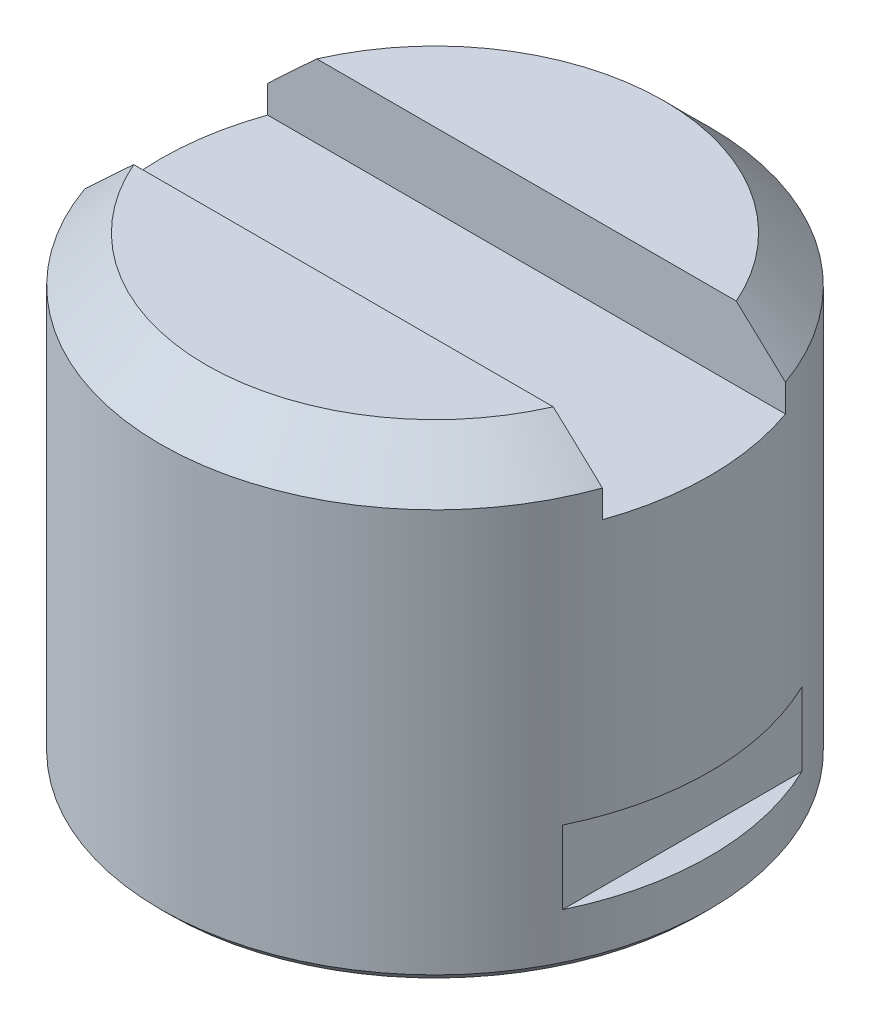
ISO-10303-21;
HEADER;
FILE_DESCRIPTION(('STEP AP214'),'2;1');
FILE_NAME('part.step','',(''),(''),'','','');
FILE_SCHEMA(('AUTOMOTIVE_DESIGN { 1 0 10303 214 1 1 1 1 }'));
ENDSEC;
DATA;
#1=APPLICATION_CONTEXT('core data for automotive mechanical design processes');
#2=APPLICATION_PROTOCOL_DEFINITION('international standard','automotive_design',2000,#1);
#3=PRODUCT_CONTEXT('',#1,'mechanical');
#4=PRODUCT('Part','Part','',(#3));
#5=PRODUCT_RELATED_PRODUCT_CATEGORY('part','',(#4));
#6=PRODUCT_DEFINITION_FORMATION('','',#4);
#7=PRODUCT_DEFINITION_CONTEXT('part definition',#1,'design');
#8=PRODUCT_DEFINITION('design','',#6,#7);
#9=PRODUCT_DEFINITION_SHAPE('','',#8);
#10=(LENGTH_UNIT() NAMED_UNIT(*) SI_UNIT(.MILLI.,.METRE.));
#11=(NAMED_UNIT(*) PLANE_ANGLE_UNIT() SI_UNIT($,.RADIAN.));
#12=(NAMED_UNIT(*) SI_UNIT($,.STERADIAN.) SOLID_ANGLE_UNIT());
#13=UNCERTAINTY_MEASURE_WITH_UNIT(LENGTH_MEASURE(1.E-05),#10,'distance_accuracy_value','');
#14=(GEOMETRIC_REPRESENTATION_CONTEXT(3) GLOBAL_UNCERTAINTY_ASSIGNED_CONTEXT((#13)) GLOBAL_UNIT_ASSIGNED_CONTEXT((#10,
#11,#12)) REPRESENTATION_CONTEXT('',''));
#15=CARTESIAN_POINT('',(0.,0.,0.));
#16=DIRECTION('',(0.,0.,1.));
#17=DIRECTION('',(1.,0.,0.));
#18=AXIS2_PLACEMENT_3D('',#15,#16,#17);
#19=CARTESIAN_POINT('',(0.,50.,0.));
#20=DIRECTION('',(0.,1.,0.));
#21=DIRECTION('',(0.,0.,1.));
#22=AXIS2_PLACEMENT_3D('',#19,#20,#21);
#23=PLANE('',#22);
#24=DIRECTION('',(1.,0.,0.));
#25=VECTOR('',#24,1.);
#26=CARTESIAN_POINT('',(-30.,50.,9.99999999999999));
#27=LINE('',#26,#25);
#28=CARTESIAN_POINT('',(-22.9128784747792,50.,9.99999999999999));
#29=VERTEX_POINT('',#28);
#30=CARTESIAN_POINT('',(22.9128784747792,50.,9.99999999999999));
#31=VERTEX_POINT('',#30);
#32=EDGE_CURVE('E138',#29,#31,#27,.T.);
#33=ORIENTED_EDGE('',*,*,#32,.F.);
#34=CARTESIAN_POINT('',(0.,50.,0.));
#35=DIRECTION('',(0.,1.,0.));
#36=DIRECTION('',(0.,0.,1.));
#37=AXIS2_PLACEMENT_3D('',#34,#35,#36);
#38=CIRCLE('',#37,25.);
#39=EDGE_CURVE('E143',#29,#31,#38,.T.);
#40=ORIENTED_EDGE('',*,*,#39,.T.);
#41=EDGE_LOOP('',(#33,#40));
#42=FACE_BOUND('',#41,.T.);
#43=ADVANCED_FACE('F46',(#42),#23,.T.);
#44=CARTESIAN_POINT('',(0.,50.,0.));
#45=DIRECTION('',(0.,-1.,0.));
#46=DIRECTION('',(0.,0.,-1.));
#47=AXIS2_PLACEMENT_3D('',#44,#45,#46);
#48=CONICAL_SURFACE('',#47,25.,0.785398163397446);
#49=CARTESIAN_POINT('',(-65.3644664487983,8.87501626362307,10.));
#50=CARTESIAN_POINT('',(-64.4084204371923,9.82006334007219,10.));
#51=CARTESIAN_POINT('',(-63.4521407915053,10.7648740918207,10.));
#52=CARTESIAN_POINT('',(-61.5390376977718,12.6539476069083,10.));
#53=CARTESIAN_POINT('',(-60.5822142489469,13.598210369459,10.));
#54=CARTESIAN_POINT('',(-57.7096946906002,16.431166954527,10.));
#55=CARTESIAN_POINT('',(-55.7930707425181,18.3189202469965,10.));
#56=CARTESIAN_POINT('',(-51.9354031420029,22.1118137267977,10.));
#57=CARTESIAN_POINT('',(-49.9943228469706,24.0169166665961,10.));
#58=CARTESIAN_POINT('',(-47.079701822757,26.8703883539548,10.));
#59=CARTESIAN_POINT('',(-46.1079415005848,27.8205755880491,10.));
#60=CARTESIAN_POINT('',(-44.1630017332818,29.7194698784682,10.));
#61=CARTESIAN_POINT('',(-43.1898223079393,30.6681769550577,10.));
#62=CARTESIAN_POINT('',(-40.8635143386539,32.9318481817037,10.));
#63=CARTESIAN_POINT('',(-39.5095833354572,34.2459880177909,10.));
#64=CARTESIAN_POINT('',(-36.7971986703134,36.8697614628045,10.));
#65=CARTESIAN_POINT('',(-35.4387447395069,38.1793947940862,10.));
#66=CARTESIAN_POINT('',(-33.395067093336,40.1403680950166,10.));
#67=CARTESIAN_POINT('',(-32.7121460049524,40.7941077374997,10.));
#68=CARTESIAN_POINT('',(-31.3444537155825,42.0996483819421,10.));
#69=CARTESIAN_POINT('',(-30.6596825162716,42.7514493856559,10.));
#70=CARTESIAN_POINT('',(-29.2880684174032,44.0525630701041,10.));
#71=CARTESIAN_POINT('',(-28.6012260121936,44.701876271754,10.));
#72=CARTESIAN_POINT('',(-27.2248356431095,45.9976249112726,10.));
#73=CARTESIAN_POINT('',(-26.5352876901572,46.6440603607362,10.));
#74=CARTESIAN_POINT('',(-25.1588162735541,47.9277845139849,10.));
#75=CARTESIAN_POINT('',(-24.4719215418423,48.5651040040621,10.));
#76=CARTESIAN_POINT('',(-23.0940123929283,49.8353022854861,9.99999999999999));
#77=CARTESIAN_POINT('',(-22.4029979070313,50.4681810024,9.99999999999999));
#78=CARTESIAN_POINT('',(-21.0151253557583,51.728749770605,9.99999999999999));
#79=CARTESIAN_POINT('',(-20.3182626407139,52.356434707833,9.99999999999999));
#80=CARTESIAN_POINT('',(-18.9177877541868,53.6041778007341,9.99999999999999));
#81=CARTESIAN_POINT('',(-18.214175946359,54.2242363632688,9.99999999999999));
#82=CARTESIAN_POINT('',(-17.1533626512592,55.1453411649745,9.99999999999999));
#83=CARTESIAN_POINT('',(-16.7995528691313,55.4502939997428,9.99999999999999));
#84=CARTESIAN_POINT('',(-16.0893184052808,56.0571371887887,9.99999999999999));
#85=CARTESIAN_POINT('',(-15.7328937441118,56.3590275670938,9.99999999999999));
#86=CARTESIAN_POINT('',(-15.0168956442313,56.9592392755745,9.99999999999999));
#87=CARTESIAN_POINT('',(-14.6573214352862,57.2575596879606,9.99999999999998));
#88=CARTESIAN_POINT('',(-13.9345690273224,57.8498021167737,9.99999999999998));
#89=CARTESIAN_POINT('',(-13.5713908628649,58.143724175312,9.99999999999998));
#90=CARTESIAN_POINT('',(-12.8413159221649,58.7257599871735,9.99999999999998));
#91=CARTESIAN_POINT('',(-12.4744257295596,59.0138819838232,9.99999999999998));
#92=CARTESIAN_POINT('',(-11.7355271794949,59.5835413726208,9.99999999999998));
#93=CARTESIAN_POINT('',(-11.3635185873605,59.8650784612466,9.99999999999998));
#94=CARTESIAN_POINT('',(-10.6135438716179,60.4197524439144,9.99999999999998));
#95=CARTESIAN_POINT('',(-10.2355805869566,60.6928931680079,9.99999999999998));
#96=CARTESIAN_POINT('',(-9.47228445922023,61.2286463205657,9.99999999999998));
#97=CARTESIAN_POINT('',(-9.08695262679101,61.4912601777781,9.99999999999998));
#98=CARTESIAN_POINT('',(-8.59967155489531,61.8110282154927,9.99999999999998));
#99=CARTESIAN_POINT('',(-8.50190286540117,61.8745771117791,9.99999999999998));
#100=CARTESIAN_POINT('',(-8.30577059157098,62.000762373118,9.99999999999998));
#101=CARTESIAN_POINT('',(-8.20740697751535,62.0633986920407,9.99999999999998));
#102=CARTESIAN_POINT('',(-8.01005188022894,62.1876989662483,9.99999999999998));
#103=CARTESIAN_POINT('',(-7.91106032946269,62.2493628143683,9.99999999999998));
#104=CARTESIAN_POINT('',(-7.71243223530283,62.3716395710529,9.99999999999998));
#105=CARTESIAN_POINT('',(-7.61279569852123,62.4322524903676,9.99999999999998));
#106=CARTESIAN_POINT('',(-7.31283812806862,62.6124247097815,9.99999999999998));
#107=CARTESIAN_POINT('',(-7.11149900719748,62.7302986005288,9.99999999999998));
#108=CARTESIAN_POINT('',(-6.70587341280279,62.9608597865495,9.99999999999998));
#109=CARTESIAN_POINT('',(-6.50158698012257,63.0735471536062,9.99999999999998));
#110=CARTESIAN_POINT('',(-6.09140900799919,63.2920807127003,9.99999999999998));
#111=CARTESIAN_POINT('',(-5.88554235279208,63.3979733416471,9.99999999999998));
#112=CARTESIAN_POINT('',(-5.47044909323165,63.602927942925,9.99999999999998));
#113=CARTESIAN_POINT('',(-5.26122240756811,63.7019897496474,9.99999999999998));
#114=CARTESIAN_POINT('',(-4.62826346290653,63.9873317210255,9.99999999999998));
#115=CARTESIAN_POINT('',(-4.19904989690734,64.1618785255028,9.99999999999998));
#116=CARTESIAN_POINT('',(-3.47039222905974,64.4184591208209,9.99999999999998));
#117=CARTESIAN_POINT('',(-3.17499506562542,64.5119948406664,9.99999999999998));
#118=CARTESIAN_POINT('',(-2.57807430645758,64.6770030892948,9.99999999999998));
#119=CARTESIAN_POINT('',(-2.27655208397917,64.7484805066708,9.99999999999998));
#120=CARTESIAN_POINT('',(-1.6695806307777,64.8659372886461,9.99999999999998));
#121=CARTESIAN_POINT('',(-1.36414828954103,64.9120027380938,9.99999999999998));
#122=CARTESIAN_POINT('',(-0.750339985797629,64.9765313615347,9.99999999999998));
#123=CARTESIAN_POINT('',(-0.441964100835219,64.9949952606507,9.99999999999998));
#124=CARTESIAN_POINT('',(0.176559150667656,65.0032438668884,9.99999999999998));
#125=CARTESIAN_POINT('',(0.486708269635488,64.992899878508,9.99999999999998));
#126=CARTESIAN_POINT('',(1.10473358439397,64.9438828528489,9.99999999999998));
#127=CARTESIAN_POINT('',(1.41260968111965,64.9052085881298,9.99999999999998));
#128=CARTESIAN_POINT('',(2.02478370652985,64.8015493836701,9.99999999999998));
#129=CARTESIAN_POINT('',(2.32906808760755,64.7364856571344,9.99999999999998));
#130=CARTESIAN_POINT('',(2.93169426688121,64.5831947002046,9.99999999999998));
#131=CARTESIAN_POINT('',(3.23003546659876,64.494965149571,9.99999999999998));
#132=CARTESIAN_POINT('',(3.83484796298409,64.2938967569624,9.99999999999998));
#133=CARTESIAN_POINT('',(4.14098015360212,64.1800482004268,9.99999999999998));
#134=CARTESIAN_POINT('',(4.74600489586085,63.9343742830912,9.99999999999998));
#135=CARTESIAN_POINT('',(5.04489459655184,63.8025419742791,9.99999999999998));
#136=CARTESIAN_POINT('',(5.63616156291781,63.5240162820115,9.99999999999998));
#137=CARTESIAN_POINT('',(5.92852840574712,63.377300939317,9.99999999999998));
#138=CARTESIAN_POINT('',(6.50687191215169,63.071920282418,9.99999999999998));
#139=CARTESIAN_POINT('',(6.79284928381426,62.9132563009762,9.99999999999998));
#140=CARTESIAN_POINT('',(7.36135649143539,62.5848756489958,9.99999999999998));
#141=CARTESIAN_POINT('',(7.64384166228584,62.4150820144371,9.99999999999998));
#142=CARTESIAN_POINT('',(8.20374548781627,62.0673550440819,9.99999999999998));
#143=CARTESIAN_POINT('',(8.48116403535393,61.8894215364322,9.99999999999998));
#144=CARTESIAN_POINT('',(9.03130723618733,61.5269998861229,9.99999999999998));
#145=CARTESIAN_POINT('',(9.30403596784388,61.3425179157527,9.99999999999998));
#146=CARTESIAN_POINT('',(9.84560947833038,60.9679728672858,9.99999999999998));
#147=CARTESIAN_POINT('',(10.1144543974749,60.7779099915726,9.99999999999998));
#148=CARTESIAN_POINT('',(10.6723910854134,60.3760733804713,9.99999999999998));
#149=CARTESIAN_POINT('',(10.961170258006,60.1638663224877,9.99999999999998));
#150=CARTESIAN_POINT('',(11.5352657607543,59.734810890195,9.99999999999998));
#151=CARTESIAN_POINT('',(11.8205819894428,59.5179623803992,9.99999999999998));
#152=CARTESIAN_POINT('',(12.3882373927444,59.0803348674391,9.99999999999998));
#153=CARTESIAN_POINT('',(12.6705761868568,58.8595553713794,9.99999999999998));
#154=CARTESIAN_POINT('',(13.2326275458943,58.4146755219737,9.99999999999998));
#155=CARTESIAN_POINT('',(13.5123400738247,58.1905751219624,9.99999999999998));
#156=CARTESIAN_POINT('',(14.3483275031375,57.5138034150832,9.99999999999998));
#157=CARTESIAN_POINT('',(14.9011650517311,57.0568846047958,9.99999999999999));
#158=CARTESIAN_POINT('',(15.9996989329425,56.1346463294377,9.99999999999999));
#159=CARTESIAN_POINT('',(16.5453957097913,55.6693273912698,9.99999999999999));
#160=CARTESIAN_POINT('',(17.6321617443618,54.7313615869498,9.99999999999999));
#161=CARTESIAN_POINT('',(18.1732209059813,54.2587030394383,9.99999999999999));
#162=CARTESIAN_POINT('',(19.2508443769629,53.3082831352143,9.99999999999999));
#163=CARTESIAN_POINT('',(19.7874086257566,52.8305217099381,9.99999999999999));
#164=CARTESIAN_POINT('',(20.8567225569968,51.8710743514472,9.99999999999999));
#165=CARTESIAN_POINT('',(21.3894733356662,51.3893896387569,9.99999999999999));
#166=CARTESIAN_POINT('',(22.4519706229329,50.4227259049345,9.99999999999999));
#167=CARTESIAN_POINT('',(22.9817171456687,49.9377468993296,9.99999999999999));
#168=CARTESIAN_POINT('',(24.0370887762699,48.9665770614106,10.));
#169=CARTESIAN_POINT('',(24.5627215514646,48.4803945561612,10.));
#170=CARTESIAN_POINT('',(25.6119022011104,47.5057843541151,10.));
#171=CARTESIAN_POINT('',(26.1354500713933,47.0173566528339,10.));
#172=CARTESIAN_POINT('',(27.7035297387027,45.5491908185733,10.));
#173=CARTESIAN_POINT('',(28.7454251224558,44.5666368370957,10.));
#174=CARTESIAN_POINT('',(30.8230293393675,42.5970618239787,10.));
#175=CARTESIAN_POINT('',(31.8587432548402,41.6100461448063,10.));
#176=CARTESIAN_POINT('',(33.9262354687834,39.6319475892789,10.));
#177=CARTESIAN_POINT('',(34.9580138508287,38.6408648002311,10.));
#178=CARTESIAN_POINT('',(37.2221843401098,36.4593487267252,10.));
#179=CARTESIAN_POINT('',(38.453918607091,35.2682330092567,10.));
#180=CARTESIAN_POINT('',(40.9141124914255,32.8826108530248,10.));
#181=CARTESIAN_POINT('',(42.1425720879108,31.6881043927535,10.));
#182=CARTESIAN_POINT('',(44.5973677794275,29.2960702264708,10.));
#183=CARTESIAN_POINT('',(45.8237030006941,28.0985416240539,10.));
#184=CARTESIAN_POINT('',(48.2743620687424,25.7014279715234,10.));
#185=CARTESIAN_POINT('',(49.49868591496,24.5018429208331,10.));
#186=CARTESIAN_POINT('',(51.9451430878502,22.1015882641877,10.));
#187=CARTESIAN_POINT('',(53.1672771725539,20.9009194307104,10.));
#188=CARTESIAN_POINT('',(55.6102282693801,18.4982411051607,10.));
#189=CARTESIAN_POINT('',(56.8310452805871,17.2962316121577,10.));
#190=CARTESIAN_POINT('',(59.2711495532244,14.891546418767,10.));
#191=CARTESIAN_POINT('',(60.4904372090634,13.6888711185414,10.));
#192=CARTESIAN_POINT('',(62.9280960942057,11.2825946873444,10.));
#193=CARTESIAN_POINT('',(64.146467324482,10.0789935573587,10.));
#194=CARTESIAN_POINT('',(65.3644664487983,8.87501626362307,10.));
#195=B_SPLINE_CURVE_WITH_KNOTS('',3,(#49,#50,#51,#52,#53,#54,#55,#56,#57,#58,#59,#60,#61,#62,
#63,#64,#65,#66,#67,#68,#69,#70,#71,#72,#73,#74,#75,#76,#77,#78,#79,#80,#81,#82,#83,#84,#85,#86,
#87,#88,#89,#90,#91,#92,#93,#94,#95,#96,#97,#98,#99,#100,#101,#102,#103,#104,#105,#106,#107,
#108,#109,#110,#111,#112,#113,#114,#115,#116,#117,#118,#119,#120,#121,#122,#123,#124,#125,#126,
#127,#128,#129,#130,#131,#132,#133,#134,#135,#136,#137,#138,#139,#140,#141,#142,#143,#144,#145,
#146,#147,#148,#149,#150,#151,#152,#153,#154,#155,#156,#157,#158,#159,#160,#161,#162,#163,#164,
#165,#166,#167,#168,#169,#170,#171,#172,#173,#174,#175,#176,#177,#178,#179,#180,#181,#182,#183,
#184,#185,#186,#187,#188,#189,#190,#191,#192,#193,#194),.UNSPECIFIED.,.F.,.F.,(4,2,2,2,2,2,2,2,
2,2,2,2,2,2,2,2,2,2,2,2,2,2,2,2,2,2,2,2,2,2,2,2,2,2,2,2,2,2,2,2,2,2,2,2,2,2,2,2,2,2,2,2,2,2,2,2,
2,2,2,2,2,2,2,2,2,2,2,2,2,2,2,2,4),(0.,4.0328949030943,8.06579559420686,16.1363280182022,
24.295664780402,28.3729868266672,32.4502525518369,38.1107077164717,43.7715055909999,
46.6076638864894,49.4438196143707,52.2793449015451,55.1148587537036,57.9258942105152,
60.7369766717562,63.5505587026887,66.3639899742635,67.7652608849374,69.1665207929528,
70.5681335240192,71.9697328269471,73.3691749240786,74.7686813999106,76.1675397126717,
77.5662075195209,77.9160248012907,78.2658597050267,78.6157328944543,78.9656025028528,
79.6654476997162,80.3652832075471,81.0596694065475,81.7540724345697,83.1421885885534,
84.0710581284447,84.9997216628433,85.9252196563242,86.8506933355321,87.7803080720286,
88.7099630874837,89.6424142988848,90.5749589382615,91.5541204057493,92.5336612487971,
93.5146689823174,94.495567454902,95.4841634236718,96.472780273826,97.4604888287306,
98.4481616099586,99.5231994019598,100.598268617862,101.67347359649,102.748693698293,
104.900224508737,107.051620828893,109.206889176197,111.36218651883,113.516837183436,
115.671477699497,117.81948503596,119.967496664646,124.263815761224,128.555903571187,
132.847899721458,137.988254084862,143.128641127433,148.270792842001,153.41294599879,
158.552687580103,163.69243273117,168.830312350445,173.968186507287),.UNSPECIFIED.);
#196=CARTESIAN_POINT('',(-28.2842712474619,45.,10.));
#197=VERTEX_POINT('',#196);
#198=EDGE_CURVE('E227',#197,#29,#195,.T.);
#199=ORIENTED_EDGE('',*,*,#198,.F.);
#200=CARTESIAN_POINT('',(0.,45.,0.));
#201=DIRECTION('',(0.,1.,0.));
#202=DIRECTION('',(0.,0.,1.));
#203=AXIS2_PLACEMENT_3D('',#200,#201,#202);
#204=CIRCLE('',#203,30.);
#205=CARTESIAN_POINT('',(28.2842712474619,45.,10.));
#206=VERTEX_POINT('',#205);
#207=EDGE_CURVE('E142',#206,#197,#204,.F.);
#208=ORIENTED_EDGE('',*,*,#207,.F.);
#209=EDGE_CURVE('E131',#31,#206,#195,.T.);
#210=ORIENTED_EDGE('',*,*,#209,.F.);
#211=ORIENTED_EDGE('',*,*,#39,.F.);
#212=EDGE_LOOP('',(#199,#208,#210,#211));
#213=FACE_BOUND('',#212,.T.);
#214=ADVANCED_FACE('F209',(#213),#48,.T.);
#215=CARTESIAN_POINT('',(0.,50.,0.));
#216=DIRECTION('',(0.,-1.,0.));
#217=DIRECTION('',(0.,0.,-1.));
#218=AXIS2_PLACEMENT_3D('',#215,#216,#217);
#219=CYLINDRICAL_SURFACE('',#218,30.);
#220=CARTESIAN_POINT('',(0.,1.,0.));
#221=DIRECTION('',(0.,1.,0.));
#222=DIRECTION('',(0.,0.,1.));
#223=AXIS2_PLACEMENT_3D('',#220,#221,#222);
#224=CIRCLE('',#223,30.);
#225=CARTESIAN_POINT('',(0.,1.,30.));
#226=VERTEX_POINT('',#225);
#227=EDGE_CURVE('E153',#226,#226,#224,.T.);
#228=ORIENTED_EDGE('',*,*,#227,.T.);
#229=EDGE_LOOP('',(#228));
#230=FACE_BOUND('',#229,.T.);
#231=CARTESIAN_POINT('',(-28.2842712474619,45.,-10.));
#232=VERTEX_POINT('',#231);
#233=CARTESIAN_POINT('',(28.2842712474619,45.,-10.));
#234=VERTEX_POINT('',#233);
#235=EDGE_CURVE('E146',#232,#234,#204,.F.);
#236=ORIENTED_EDGE('',*,*,#235,.T.);
#237=DIRECTION('',(0.,-1.,0.));
#238=VECTOR('',#237,1.);
#239=CARTESIAN_POINT('',(28.2842712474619,50.,-9.99999999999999));
#240=LINE('',#239,#238);
#241=CARTESIAN_POINT('',(28.2842712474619,42.,-9.99999999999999));
#242=VERTEX_POINT('',#241);
#243=EDGE_CURVE('E126',#234,#242,#240,.T.);
#244=ORIENTED_EDGE('',*,*,#243,.T.);
#245=CARTESIAN_POINT('',(0.,42.,0.));
#246=DIRECTION('',(0.,-1.,0.));
#247=DIRECTION('',(0.,0.,-1.));
#248=AXIS2_PLACEMENT_3D('',#245,#246,#247);
#249=CIRCLE('',#248,30.);
#250=CARTESIAN_POINT('',(28.2842712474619,42.,10.));
#251=VERTEX_POINT('',#250);
#252=EDGE_CURVE('E50',#242,#251,#249,.T.);
#253=ORIENTED_EDGE('',*,*,#252,.T.);
#254=DIRECTION('',(0.,-1.,0.));
#255=VECTOR('',#254,1.);
#256=CARTESIAN_POINT('',(28.2842712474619,50.,9.99999999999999));
#257=LINE('',#256,#255);
#258=EDGE_CURVE('E231',#251,#206,#257,.F.);
#259=ORIENTED_EDGE('',*,*,#258,.T.);
#260=ORIENTED_EDGE('',*,*,#207,.T.);
#261=DIRECTION('',(0.,-1.,0.));
#262=VECTOR('',#261,1.);
#263=CARTESIAN_POINT('',(-28.2842712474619,50.,9.99999999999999));
#264=LINE('',#263,#262);
#265=CARTESIAN_POINT('',(-28.2842712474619,42.,10.));
#266=VERTEX_POINT('',#265);
#267=EDGE_CURVE('E243',#197,#266,#264,.T.);
#268=ORIENTED_EDGE('',*,*,#267,.T.);
#269=CARTESIAN_POINT('',(-28.2842712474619,42.,-9.99999999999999));
#270=VERTEX_POINT('',#269);
#271=EDGE_CURVE('E13',#266,#270,#249,.T.);
#272=ORIENTED_EDGE('',*,*,#271,.T.);
#273=DIRECTION('',(0.,-1.,0.));
#274=VECTOR('',#273,1.);
#275=CARTESIAN_POINT('',(-28.2842712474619,50.,-9.99999999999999));
#276=LINE('',#275,#274);
#277=EDGE_CURVE('E223',#270,#232,#276,.F.);
#278=ORIENTED_EDGE('',*,*,#277,.T.);
#279=EDGE_LOOP('',(#236,#244,#253,#259,#260,#268,#272,#278));
#280=FACE_BOUND('',#279,.T.);
#281=DIRECTION('',(0.,-1.,0.));
#282=VECTOR('',#281,1.);
#283=CARTESIAN_POINT('',(27.,50.,-13.076696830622));
#284=LINE('',#283,#282);
#285=CARTESIAN_POINT('',(27.,14.,-13.076696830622));
#286=VERTEX_POINT('',#285);
#287=CARTESIAN_POINT('',(27.,6.,-13.076696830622));
#288=VERTEX_POINT('',#287);
#289=EDGE_CURVE('E149',#286,#288,#284,.T.);
#290=ORIENTED_EDGE('',*,*,#289,.T.);
#291=CARTESIAN_POINT('',(0.,6.00000000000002,0.));
#292=DIRECTION('',(0.,-1.,0.));
#293=DIRECTION('',(1.,0.,0.));
#294=AXIS2_PLACEMENT_3D('',#291,#292,#293);
#295=CIRCLE('',#294,30.);
#296=CARTESIAN_POINT('',(27.,6.,13.076696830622));
#297=VERTEX_POINT('',#296);
#298=EDGE_CURVE('E272',#288,#297,#295,.T.);
#299=ORIENTED_EDGE('',*,*,#298,.T.);
#300=DIRECTION('',(0.,-1.,0.));
#301=VECTOR('',#300,1.);
#302=CARTESIAN_POINT('',(27.,50.,13.076696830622));
#303=LINE('',#302,#301);
#304=CARTESIAN_POINT('',(27.,14.,13.076696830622));
#305=VERTEX_POINT('',#304);
#306=EDGE_CURVE('E269',#297,#305,#303,.F.);
#307=ORIENTED_EDGE('',*,*,#306,.T.);
#308=CARTESIAN_POINT('',(0.,14.,0.));
#309=DIRECTION('',(0.,1.,0.));
#310=DIRECTION('',(0.,0.,1.));
#311=AXIS2_PLACEMENT_3D('',#308,#309,#310);
#312=CIRCLE('',#311,30.);
#313=EDGE_CURVE('E68',#305,#286,#312,.T.);
#314=ORIENTED_EDGE('',*,*,#313,.T.);
#315=EDGE_LOOP('',(#290,#299,#307,#314));
#316=FACE_BOUND('',#315,.T.);
#317=DIRECTION('',(0.,-1.,0.));
#318=VECTOR('',#317,1.);
#319=CARTESIAN_POINT('',(-27.,50.,-13.076696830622));
#320=LINE('',#319,#318);
#321=CARTESIAN_POINT('',(-27.,6.,-13.076696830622));
#322=VERTEX_POINT('',#321);
#323=CARTESIAN_POINT('',(-27.,14.,-13.076696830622));
#324=VERTEX_POINT('',#323);
#325=EDGE_CURVE('E260',#322,#324,#320,.F.);
#326=ORIENTED_EDGE('',*,*,#325,.T.);
#327=CARTESIAN_POINT('',(0.,14.,0.));
#328=DIRECTION('',(0.,1.,0.));
#329=DIRECTION('',(0.,0.,1.));
#330=AXIS2_PLACEMENT_3D('',#327,#328,#329);
#331=CIRCLE('',#330,30.);
#332=CARTESIAN_POINT('',(-27.,14.,13.076696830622));
#333=VERTEX_POINT('',#332);
#334=EDGE_CURVE('E266',#324,#333,#331,.T.);
#335=ORIENTED_EDGE('',*,*,#334,.T.);
#336=DIRECTION('',(0.,-1.,0.));
#337=VECTOR('',#336,1.);
#338=CARTESIAN_POINT('',(-27.,50.,13.076696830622));
#339=LINE('',#338,#337);
#340=CARTESIAN_POINT('',(-27.,6.,13.076696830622));
#341=VERTEX_POINT('',#340);
#342=EDGE_CURVE('E263',#333,#341,#339,.T.);
#343=ORIENTED_EDGE('',*,*,#342,.T.);
#344=CARTESIAN_POINT('',(0.,6.00000000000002,0.));
#345=DIRECTION('',(0.,-1.,0.));
#346=DIRECTION('',(1.,0.,0.));
#347=AXIS2_PLACEMENT_3D('',#344,#345,#346);
#348=CIRCLE('',#347,30.);
#349=EDGE_CURVE('E255',#341,#322,#348,.T.);
#350=ORIENTED_EDGE('',*,*,#349,.T.);
#351=EDGE_LOOP('',(#326,#335,#343,#350));
#352=FACE_BOUND('',#351,.T.);
#353=ADVANCED_FACE('F205',(#230,#280,#316,#352),#219,.T.);
#354=DIRECTION('',(1.,0.,0.));
#355=VECTOR('',#354,1.);
#356=CARTESIAN_POINT('',(-30.,50.,-9.99999999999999));
#357=LINE('',#356,#355);
#358=CARTESIAN_POINT('',(-22.9128784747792,50.,-9.99999999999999));
#359=VERTEX_POINT('',#358);
#360=CARTESIAN_POINT('',(22.9128784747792,50.,-9.99999999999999));
#361=VERTEX_POINT('',#360);
#362=EDGE_CURVE('E61',#359,#361,#357,.T.);
#363=ORIENTED_EDGE('',*,*,#362,.T.);
#364=EDGE_CURVE('E137',#361,#359,#38,.T.);
#365=ORIENTED_EDGE('',*,*,#364,.T.);
#366=EDGE_LOOP('',(#363,#365));
#367=FACE_BOUND('',#366,.T.);
#368=ADVANCED_FACE('F136',(#367),#23,.T.);
#369=CARTESIAN_POINT('',(0.,0.,0.));
#370=DIRECTION('',(0.,1.,0.));
#371=DIRECTION('',(0.,0.,1.));
#372=AXIS2_PLACEMENT_3D('',#369,#370,#371);
#373=PLANE('',#372);
#374=CARTESIAN_POINT('',(0.,0.,0.));
#375=DIRECTION('',(0.,1.,0.));
#376=DIRECTION('',(0.,0.,1.));
#377=AXIS2_PLACEMENT_3D('',#374,#375,#376);
#378=CIRCLE('',#377,29.);
#379=CARTESIAN_POINT('',(0.,0.,29.));
#380=VERTEX_POINT('',#379);
#381=EDGE_CURVE('E156',#380,#380,#378,.F.);
#382=ORIENTED_EDGE('',*,*,#381,.T.);
#383=EDGE_LOOP('',(#382));
#384=FACE_BOUND('',#383,.T.);
#385=ADVANCED_FACE('F195',(#384),#373,.F.);
#386=CARTESIAN_POINT('',(-30.,14.,-30.));
#387=DIRECTION('',(0.,1.,0.));
#388=DIRECTION('',(0.,0.,1.));
#389=AXIS2_PLACEMENT_3D('',#386,#387,#388);
#390=PLANE('',#389);
#391=DIRECTION('',(0.,0.,1.));
#392=VECTOR('',#391,1.);
#393=CARTESIAN_POINT('',(-27.,14.,-30.));
#394=LINE('',#393,#392);
#395=EDGE_CURVE('E252',#324,#333,#394,.T.);
#396=ORIENTED_EDGE('',*,*,#395,.T.);
#397=ORIENTED_EDGE('',*,*,#334,.F.);
#398=EDGE_LOOP('',(#396,#397));
#399=FACE_BOUND('',#398,.T.);
#400=ADVANCED_FACE('F191',(#399),#390,.F.);
#401=CARTESIAN_POINT('',(-27.,14.,-30.));
#402=DIRECTION('',(1.,0.,0.));
#403=DIRECTION('',(0.,0.,-1.));
#404=AXIS2_PLACEMENT_3D('',#401,#402,#403);
#405=PLANE('',#404);
#406=ORIENTED_EDGE('',*,*,#395,.F.);
#407=ORIENTED_EDGE('',*,*,#325,.F.);
#408=DIRECTION('',(0.,0.,1.));
#409=VECTOR('',#408,1.);
#410=CARTESIAN_POINT('',(-27.,6.,-30.));
#411=LINE('',#410,#409);
#412=EDGE_CURVE('E250',#322,#341,#411,.T.);
#413=ORIENTED_EDGE('',*,*,#412,.T.);
#414=ORIENTED_EDGE('',*,*,#342,.F.);
#415=EDGE_LOOP('',(#406,#407,#413,#414));
#416=FACE_BOUND('',#415,.T.);
#417=ADVANCED_FACE('F194',(#416),#405,.F.);
#418=CARTESIAN_POINT('',(-30.,6.,-30.));
#419=DIRECTION('',(0.,-1.,0.));
#420=DIRECTION('',(1.,0.,0.));
#421=AXIS2_PLACEMENT_3D('',#418,#419,#420);
#422=PLANE('',#421);
#423=ORIENTED_EDGE('',*,*,#412,.F.);
#424=ORIENTED_EDGE('',*,*,#349,.F.);
#425=EDGE_LOOP('',(#423,#424));
#426=FACE_BOUND('',#425,.T.);
#427=ADVANCED_FACE('F190',(#426),#422,.F.);
#428=CARTESIAN_POINT('',(30.,14.,-30.));
#429=DIRECTION('',(0.,1.,0.));
#430=DIRECTION('',(0.,0.,1.));
#431=AXIS2_PLACEMENT_3D('',#428,#429,#430);
#432=PLANE('',#431);
#433=DIRECTION('',(0.,0.,1.));
#434=VECTOR('',#433,1.);
#435=CARTESIAN_POINT('',(27.,14.,-30.));
#436=LINE('',#435,#434);
#437=EDGE_CURVE('E246',#286,#305,#436,.T.);
#438=ORIENTED_EDGE('',*,*,#437,.F.);
#439=ORIENTED_EDGE('',*,*,#313,.F.);
#440=EDGE_LOOP('',(#438,#439));
#441=FACE_BOUND('',#440,.T.);
#442=ADVANCED_FACE('F183',(#441),#432,.F.);
#443=CARTESIAN_POINT('',(30.,6.,-30.));
#444=DIRECTION('',(0.,-1.,0.));
#445=DIRECTION('',(1.,0.,0.));
#446=AXIS2_PLACEMENT_3D('',#443,#444,#445);
#447=PLANE('',#446);
#448=ORIENTED_EDGE('',*,*,#298,.F.);
#449=DIRECTION('',(0.,0.,1.));
#450=VECTOR('',#449,1.);
#451=CARTESIAN_POINT('',(27.,6.,-30.));
#452=LINE('',#451,#450);
#453=EDGE_CURVE('E247',#288,#297,#452,.T.);
#454=ORIENTED_EDGE('',*,*,#453,.T.);
#455=EDGE_LOOP('',(#448,#454));
#456=FACE_BOUND('',#455,.T.);
#457=ADVANCED_FACE('F179',(#456),#447,.F.);
#458=CARTESIAN_POINT('',(27.,14.,-30.));
#459=DIRECTION('',(-1.,0.,0.));
#460=DIRECTION('',(0.,0.,1.));
#461=AXIS2_PLACEMENT_3D('',#458,#459,#460);
#462=PLANE('',#461);
#463=ORIENTED_EDGE('',*,*,#437,.T.);
#464=ORIENTED_EDGE('',*,*,#306,.F.);
#465=ORIENTED_EDGE('',*,*,#453,.F.);
#466=ORIENTED_EDGE('',*,*,#289,.F.);
#467=EDGE_LOOP('',(#463,#464,#465,#466));
#468=FACE_BOUND('',#467,.T.);
#469=ADVANCED_FACE('F182',(#468),#462,.F.);
#470=CARTESIAN_POINT('',(65.3644664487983,8.87501626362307,-10.));
#471=CARTESIAN_POINT('',(64.4084204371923,9.82006334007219,-10.));
#472=CARTESIAN_POINT('',(63.4521407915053,10.7648740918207,-10.));
#473=CARTESIAN_POINT('',(61.5390376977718,12.6539476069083,-10.));
#474=CARTESIAN_POINT('',(60.5822142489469,13.598210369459,-10.));
#475=CARTESIAN_POINT('',(57.7096946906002,16.431166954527,-10.));
#476=CARTESIAN_POINT('',(55.7930707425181,18.3189202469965,-10.));
#477=CARTESIAN_POINT('',(51.9354031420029,22.1118137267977,-10.));
#478=CARTESIAN_POINT('',(49.9943228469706,24.0169166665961,-10.));
#479=CARTESIAN_POINT('',(47.079701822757,26.8703883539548,-10.));
#480=CARTESIAN_POINT('',(46.1079415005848,27.8205755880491,-10.));
#481=CARTESIAN_POINT('',(44.1630017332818,29.7194698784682,-10.));
#482=CARTESIAN_POINT('',(43.1898223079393,30.6681769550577,-10.));
#483=CARTESIAN_POINT('',(40.8635143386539,32.9318481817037,-10.));
#484=CARTESIAN_POINT('',(39.5095833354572,34.2459880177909,-10.));
#485=CARTESIAN_POINT('',(36.7971986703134,36.8697614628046,-10.));
#486=CARTESIAN_POINT('',(35.4387447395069,38.1793947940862,-10.));
#487=CARTESIAN_POINT('',(33.395067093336,40.1403680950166,-10.));
#488=CARTESIAN_POINT('',(32.7121460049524,40.7941077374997,-10.));
#489=CARTESIAN_POINT('',(31.3444537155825,42.0996483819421,-10.));
#490=CARTESIAN_POINT('',(30.6596825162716,42.7514493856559,-10.));
#491=CARTESIAN_POINT('',(29.2880684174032,44.0525630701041,-10.));
#492=CARTESIAN_POINT('',(28.6012260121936,44.701876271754,-10.));
#493=CARTESIAN_POINT('',(27.2248356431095,45.9976249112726,-10.));
#494=CARTESIAN_POINT('',(26.5352876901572,46.6440603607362,-9.99999999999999));
#495=CARTESIAN_POINT('',(25.1588162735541,47.9277845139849,-9.99999999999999));
#496=CARTESIAN_POINT('',(24.4719215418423,48.5651040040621,-9.99999999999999));
#497=CARTESIAN_POINT('',(23.0940123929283,49.8353022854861,-9.99999999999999));
#498=CARTESIAN_POINT('',(22.4029979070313,50.4681810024,-9.99999999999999));
#499=CARTESIAN_POINT('',(21.0151253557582,51.728749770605,-9.99999999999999));
#500=CARTESIAN_POINT('',(20.3182626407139,52.356434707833,-9.99999999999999));
#501=CARTESIAN_POINT('',(18.9177877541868,53.6041778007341,-9.99999999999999));
#502=CARTESIAN_POINT('',(18.214175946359,54.2242363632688,-9.99999999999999));
#503=CARTESIAN_POINT('',(17.1533626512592,55.1453411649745,-9.99999999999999));
#504=CARTESIAN_POINT('',(16.7995528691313,55.4502939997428,-9.99999999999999));
#505=CARTESIAN_POINT('',(16.0893184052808,56.0571371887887,-9.99999999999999));
#506=CARTESIAN_POINT('',(15.7328937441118,56.3590275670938,-9.99999999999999));
#507=CARTESIAN_POINT('',(15.0168956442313,56.9592392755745,-9.99999999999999));
#508=CARTESIAN_POINT('',(14.6573214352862,57.2575596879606,-9.99999999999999));
#509=CARTESIAN_POINT('',(13.9345690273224,57.8498021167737,-9.99999999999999));
#510=CARTESIAN_POINT('',(13.5713908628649,58.143724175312,-9.99999999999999));
#511=CARTESIAN_POINT('',(12.8413159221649,58.7257599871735,-9.99999999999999));
#512=CARTESIAN_POINT('',(12.4744257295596,59.0138819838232,-9.99999999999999));
#513=CARTESIAN_POINT('',(11.735527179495,59.5835413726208,-9.99999999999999));
#514=CARTESIAN_POINT('',(11.3635185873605,59.8650784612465,-9.99999999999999));
#515=CARTESIAN_POINT('',(10.6135438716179,60.4197524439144,-9.99999999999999));
#516=CARTESIAN_POINT('',(10.2355805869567,60.6928931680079,-9.99999999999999));
#517=CARTESIAN_POINT('',(9.47228445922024,61.2286463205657,-9.99999999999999));
#518=CARTESIAN_POINT('',(9.08695262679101,61.491260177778,-9.99999999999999));
#519=CARTESIAN_POINT('',(8.59967155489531,61.8110282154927,-9.99999999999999));
#520=CARTESIAN_POINT('',(8.50190286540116,61.8745771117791,-9.99999999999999));
#521=CARTESIAN_POINT('',(8.30577059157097,62.000762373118,-9.99999999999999));
#522=CARTESIAN_POINT('',(8.20740697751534,62.0633986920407,-9.99999999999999));
#523=CARTESIAN_POINT('',(8.01005188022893,62.1876989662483,-9.99999999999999));
#524=CARTESIAN_POINT('',(7.91106032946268,62.2493628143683,-9.99999999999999));
#525=CARTESIAN_POINT('',(7.71243223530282,62.3716395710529,-9.99999999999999));
#526=CARTESIAN_POINT('',(7.61279569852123,62.4322524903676,-9.99999999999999));
#527=CARTESIAN_POINT('',(7.31283812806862,62.6124247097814,-9.99999999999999));
#528=CARTESIAN_POINT('',(7.11149900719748,62.7302986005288,-9.99999999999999));
#529=CARTESIAN_POINT('',(6.7058734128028,62.9608597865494,-9.99999999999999));
#530=CARTESIAN_POINT('',(6.50158698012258,63.0735471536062,-9.99999999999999));
#531=CARTESIAN_POINT('',(6.09140900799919,63.2920807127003,-9.99999999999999));
#532=CARTESIAN_POINT('',(5.88554235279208,63.3979733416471,-9.99999999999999));
#533=CARTESIAN_POINT('',(5.47044909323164,63.602927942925,-9.99999999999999));
#534=CARTESIAN_POINT('',(5.26122240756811,63.7019897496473,-9.99999999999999));
#535=CARTESIAN_POINT('',(4.62826346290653,63.9873317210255,-9.99999999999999));
#536=CARTESIAN_POINT('',(4.19904989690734,64.1618785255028,-9.99999999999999));
#537=CARTESIAN_POINT('',(3.47039222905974,64.4184591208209,-9.99999999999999));
#538=CARTESIAN_POINT('',(3.17499506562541,64.5119948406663,-9.99999999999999));
#539=CARTESIAN_POINT('',(2.57807430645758,64.6770030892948,-9.99999999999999));
#540=CARTESIAN_POINT('',(2.27655208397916,64.7484805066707,-9.99999999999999));
#541=CARTESIAN_POINT('',(1.66958063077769,64.865937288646,-9.99999999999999));
#542=CARTESIAN_POINT('',(1.36414828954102,64.9120027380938,-9.99999999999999));
#543=CARTESIAN_POINT('',(0.750339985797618,64.9765313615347,-9.99999999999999));
#544=CARTESIAN_POINT('',(0.441964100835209,64.9949952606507,-9.99999999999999));
#545=CARTESIAN_POINT('',(-0.176559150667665,65.0032438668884,-9.99999999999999));
#546=CARTESIAN_POINT('',(-0.486708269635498,64.992899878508,-9.99999999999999));
#547=CARTESIAN_POINT('',(-1.10473358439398,64.9438828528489,-9.99999999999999));
#548=CARTESIAN_POINT('',(-1.41260968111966,64.9052085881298,-9.99999999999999));
#549=CARTESIAN_POINT('',(-2.02478370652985,64.8015493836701,-9.99999999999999));
#550=CARTESIAN_POINT('',(-2.32906808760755,64.7364856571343,-9.99999999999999));
#551=CARTESIAN_POINT('',(-2.93169426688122,64.5831947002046,-9.99999999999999));
#552=CARTESIAN_POINT('',(-3.23003546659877,64.494965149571,-9.99999999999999));
#553=CARTESIAN_POINT('',(-3.83484796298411,64.2938967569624,-9.99999999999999));
#554=CARTESIAN_POINT('',(-4.14098015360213,64.1800482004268,-9.99999999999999));
#555=CARTESIAN_POINT('',(-4.74600489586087,63.9343742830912,-9.99999999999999));
#556=CARTESIAN_POINT('',(-5.04489459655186,63.8025419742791,-9.99999999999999));
#557=CARTESIAN_POINT('',(-5.63616156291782,63.5240162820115,-9.99999999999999));
#558=CARTESIAN_POINT('',(-5.92852840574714,63.377300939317,-9.99999999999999));
#559=CARTESIAN_POINT('',(-6.50687191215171,63.071920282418,-9.99999999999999));
#560=CARTESIAN_POINT('',(-6.79284928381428,62.9132563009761,-9.99999999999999));
#561=CARTESIAN_POINT('',(-7.36135649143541,62.5848756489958,-9.99999999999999));
#562=CARTESIAN_POINT('',(-7.64384166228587,62.4150820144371,-9.99999999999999));
#563=CARTESIAN_POINT('',(-8.2037454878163,62.0673550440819,-9.99999999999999));
#564=CARTESIAN_POINT('',(-8.48116403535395,61.8894215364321,-9.99999999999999));
#565=CARTESIAN_POINT('',(-9.03130723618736,61.5269998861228,-9.99999999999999));
#566=CARTESIAN_POINT('',(-9.30403596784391,61.3425179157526,-9.99999999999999));
#567=CARTESIAN_POINT('',(-9.84560947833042,60.9679728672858,-9.99999999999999));
#568=CARTESIAN_POINT('',(-10.1144543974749,60.7779099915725,-9.99999999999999));
#569=CARTESIAN_POINT('',(-10.6723910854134,60.3760733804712,-9.99999999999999));
#570=CARTESIAN_POINT('',(-10.961170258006,60.1638663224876,-9.99999999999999));
#571=CARTESIAN_POINT('',(-11.5352657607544,59.734810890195,-9.99999999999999));
#572=CARTESIAN_POINT('',(-11.8205819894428,59.5179623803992,-9.99999999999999));
#573=CARTESIAN_POINT('',(-12.3882373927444,59.0803348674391,-9.99999999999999));
#574=CARTESIAN_POINT('',(-12.6705761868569,58.8595553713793,-9.99999999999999));
#575=CARTESIAN_POINT('',(-13.2326275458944,58.4146755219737,-9.99999999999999));
#576=CARTESIAN_POINT('',(-13.5123400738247,58.1905751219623,-9.99999999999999));
#577=CARTESIAN_POINT('',(-14.3483275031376,57.5138034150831,-9.99999999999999));
#578=CARTESIAN_POINT('',(-14.9011650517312,57.0568846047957,-9.99999999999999));
#579=CARTESIAN_POINT('',(-15.9996989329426,56.1346463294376,-9.99999999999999));
#580=CARTESIAN_POINT('',(-16.5453957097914,55.6693273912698,-9.99999999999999));
#581=CARTESIAN_POINT('',(-17.6321617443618,54.7313615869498,-9.99999999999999));
#582=CARTESIAN_POINT('',(-18.1732209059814,54.2587030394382,-9.99999999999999));
#583=CARTESIAN_POINT('',(-19.2508443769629,53.3082831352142,-9.99999999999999));
#584=CARTESIAN_POINT('',(-19.7874086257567,52.8305217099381,-9.99999999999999));
#585=CARTESIAN_POINT('',(-20.8567225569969,51.8710743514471,-9.99999999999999));
#586=CARTESIAN_POINT('',(-21.3894733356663,51.3893896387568,-9.99999999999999));
#587=CARTESIAN_POINT('',(-22.451970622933,50.4227259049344,-9.99999999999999));
#588=CARTESIAN_POINT('',(-22.9817171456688,49.9377468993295,-9.99999999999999));
#589=CARTESIAN_POINT('',(-24.03708877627,48.9665770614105,-9.99999999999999));
#590=CARTESIAN_POINT('',(-24.5627215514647,48.4803945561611,-9.99999999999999));
#591=CARTESIAN_POINT('',(-25.6119022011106,47.505784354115,-9.99999999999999));
#592=CARTESIAN_POINT('',(-26.1354500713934,47.0173566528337,-9.99999999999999));
#593=CARTESIAN_POINT('',(-27.7035297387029,45.5491908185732,-9.99999999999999));
#594=CARTESIAN_POINT('',(-28.7454251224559,44.5666368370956,-10.));
#595=CARTESIAN_POINT('',(-30.8230293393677,42.5970618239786,-10.));
#596=CARTESIAN_POINT('',(-31.8587432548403,41.6100461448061,-10.));
#597=CARTESIAN_POINT('',(-33.9262354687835,39.6319475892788,-10.));
#598=CARTESIAN_POINT('',(-34.9580138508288,38.640864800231,-10.));
#599=CARTESIAN_POINT('',(-37.2221843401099,36.459348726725,-10.));
#600=CARTESIAN_POINT('',(-38.4539186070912,35.2682330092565,-10.));
#601=CARTESIAN_POINT('',(-40.9141124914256,32.8826108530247,-10.));
#602=CARTESIAN_POINT('',(-42.1425720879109,31.6881043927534,-10.));
#603=CARTESIAN_POINT('',(-44.5973677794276,29.2960702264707,-10.));
#604=CARTESIAN_POINT('',(-45.8237030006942,28.0985416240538,-10.));
#605=CARTESIAN_POINT('',(-48.2743620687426,25.7014279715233,-10.));
#606=CARTESIAN_POINT('',(-49.4986859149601,24.501842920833,-10.));
#607=CARTESIAN_POINT('',(-51.9451430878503,22.1015882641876,-10.));
#608=CARTESIAN_POINT('',(-53.167277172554,20.9009194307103,-10.));
#609=CARTESIAN_POINT('',(-55.6102282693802,18.4982411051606,-10.));
#610=CARTESIAN_POINT('',(-56.8310452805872,17.2962316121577,-10.));
#611=CARTESIAN_POINT('',(-59.2711495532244,14.8915464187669,-10.));
#612=CARTESIAN_POINT('',(-60.4904372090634,13.6888711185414,-10.));
#613=CARTESIAN_POINT('',(-62.9280960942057,11.2825946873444,-10.));
#614=CARTESIAN_POINT('',(-64.146467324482,10.0789935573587,-10.));
#615=CARTESIAN_POINT('',(-65.3644664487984,8.87501626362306,-10.));
#616=B_SPLINE_CURVE_WITH_KNOTS('',3,(#470,#471,#472,#473,#474,#475,#476,#477,#478,#479,#480,
#481,#482,#483,#484,#485,#486,#487,#488,#489,#490,#491,#492,#493,#494,#495,#496,#497,#498,#499,
#500,#501,#502,#503,#504,#505,#506,#507,#508,#509,#510,#511,#512,#513,#514,#515,#516,#517,#518,
#519,#520,#521,#522,#523,#524,#525,#526,#527,#528,#529,#530,#531,#532,#533,#534,#535,#536,#537,
#538,#539,#540,#541,#542,#543,#544,#545,#546,#547,#548,#549,#550,#551,#552,#553,#554,#555,#556,
#557,#558,#559,#560,#561,#562,#563,#564,#565,#566,#567,#568,#569,#570,#571,#572,#573,#574,#575,
#576,#577,#578,#579,#580,#581,#582,#583,#584,#585,#586,#587,#588,#589,#590,#591,#592,#593,#594,
#595,#596,#597,#598,#599,#600,#601,#602,#603,#604,#605,#606,#607,#608,#609,#610,#611,#612,#613,
#614,#615),.UNSPECIFIED.,.F.,.F.,(4,2,2,2,2,2,2,2,2,2,2,2,2,2,2,2,2,2,2,2,2,2,2,2,2,2,2,2,2,2,2,
2,2,2,2,2,2,2,2,2,2,2,2,2,2,2,2,2,2,2,2,2,2,2,2,2,2,2,2,2,2,2,2,2,2,2,2,2,2,2,2,2,4),(0.,
4.03289490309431,8.06579559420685,16.1363280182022,24.295664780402,28.3729868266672,
32.4502525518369,38.1107077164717,43.7715055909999,46.6076638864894,49.4438196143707,
52.2793449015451,55.1148587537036,57.9258942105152,60.7369766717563,63.5505587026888,
66.3639899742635,67.7652608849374,69.1665207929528,70.5681335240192,71.9697328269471,
73.3691749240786,74.7686813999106,76.1675397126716,77.5662075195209,77.9160248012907,
78.2658597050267,78.6157328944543,78.9656025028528,79.6654476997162,80.3652832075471,
81.0596694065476,81.7540724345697,83.1421885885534,84.0710581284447,84.9997216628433,
85.9252196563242,86.8506933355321,87.7803080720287,88.7099630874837,89.6424142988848,
90.5749589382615,91.5541204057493,92.5336612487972,93.5146689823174,94.495567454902,
95.4841634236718,96.4727802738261,97.4604888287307,98.4481616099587,99.5231994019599,
100.598268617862,101.67347359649,102.748693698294,104.900224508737,107.051620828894,
109.206889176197,111.362186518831,113.516837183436,115.671477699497,117.81948503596,
119.967496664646,124.263815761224,128.555903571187,132.847899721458,137.988254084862,
143.128641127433,148.270792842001,153.41294599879,158.552687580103,163.69243273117,
168.830312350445,173.968186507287),.UNSPECIFIED.);
#617=EDGE_CURVE('E122',#234,#361,#616,.T.);
#618=ORIENTED_EDGE('',*,*,#617,.F.);
#619=ORIENTED_EDGE('',*,*,#235,.F.);
#620=EDGE_CURVE('E132',#359,#232,#616,.T.);
#621=ORIENTED_EDGE('',*,*,#620,.F.);
#622=ORIENTED_EDGE('',*,*,#364,.F.);
#623=EDGE_LOOP('',(#618,#619,#621,#622));
#624=FACE_BOUND('',#623,.T.);
#625=ADVANCED_FACE('F141',(#624),#48,.T.);
#626=CARTESIAN_POINT('',(0.,1.,0.));
#627=DIRECTION('',(0.,1.,0.));
#628=DIRECTION('',(0.,0.,1.));
#629=AXIS2_PLACEMENT_3D('',#626,#627,#628);
#630=CONICAL_SURFACE('',#629,30.,0.785398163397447);
#631=ORIENTED_EDGE('',*,*,#381,.F.);
#632=EDGE_LOOP('',(#631));
#633=FACE_BOUND('',#632,.T.);
#634=ORIENTED_EDGE('',*,*,#227,.F.);
#635=EDGE_LOOP('',(#634));
#636=FACE_BOUND('',#635,.T.);
#637=ADVANCED_FACE('F48',(#633,#636),#630,.T.);
#638=CARTESIAN_POINT('',(-30.,42.,10.));
#639=DIRECTION('',(0.,-1.,0.));
#640=DIRECTION('',(0.,0.,-1.));
#641=AXIS2_PLACEMENT_3D('',#638,#639,#640);
#642=PLANE('',#641);
#643=DIRECTION('',(1.,0.,0.));
#644=VECTOR('',#643,1.);
#645=CARTESIAN_POINT('',(-30.,42.,-10.));
#646=LINE('',#645,#644);
#647=EDGE_CURVE('E139',#270,#242,#646,.T.);
#648=ORIENTED_EDGE('',*,*,#647,.F.);
#649=ORIENTED_EDGE('',*,*,#271,.F.);
#650=DIRECTION('',(1.,0.,0.));
#651=VECTOR('',#650,1.);
#652=CARTESIAN_POINT('',(-30.,42.,10.));
#653=LINE('',#652,#651);
#654=EDGE_CURVE('E235',#266,#251,#653,.T.);
#655=ORIENTED_EDGE('',*,*,#654,.T.);
#656=ORIENTED_EDGE('',*,*,#252,.F.);
#657=EDGE_LOOP('',(#648,#649,#655,#656));
#658=FACE_BOUND('',#657,.T.);
#659=ADVANCED_FACE('F172',(#658),#642,.F.);
#660=CARTESIAN_POINT('',(-30.,50.,9.99999999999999));
#661=DIRECTION('',(0.,0.,1.));
#662=DIRECTION('',(0.,-1.,0.));
#663=AXIS2_PLACEMENT_3D('',#660,#661,#662);
#664=PLANE('',#663);
#665=ORIENTED_EDGE('',*,*,#198,.T.);
#666=ORIENTED_EDGE('',*,*,#32,.T.);
#667=ORIENTED_EDGE('',*,*,#209,.T.);
#668=ORIENTED_EDGE('',*,*,#258,.F.);
#669=ORIENTED_EDGE('',*,*,#654,.F.);
#670=ORIENTED_EDGE('',*,*,#267,.F.);
#671=EDGE_LOOP('',(#665,#666,#667,#668,#669,#670));
#672=FACE_BOUND('',#671,.T.);
#673=ADVANCED_FACE('F171',(#672),#664,.F.);
#674=CARTESIAN_POINT('',(-30.,50.,-9.99999999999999));
#675=DIRECTION('',(0.,0.,-1.));
#676=DIRECTION('',(0.,1.,0.));
#677=AXIS2_PLACEMENT_3D('',#674,#675,#676);
#678=PLANE('',#677);
#679=ORIENTED_EDGE('',*,*,#617,.T.);
#680=ORIENTED_EDGE('',*,*,#362,.F.);
#681=ORIENTED_EDGE('',*,*,#620,.T.);
#682=ORIENTED_EDGE('',*,*,#277,.F.);
#683=ORIENTED_EDGE('',*,*,#647,.T.);
#684=ORIENTED_EDGE('',*,*,#243,.F.);
#685=EDGE_LOOP('',(#679,#680,#681,#682,#683,#684));
#686=FACE_BOUND('',#685,.T.);
#687=ADVANCED_FACE('F123',(#686),#678,.F.);
#688=CLOSED_SHELL('',(#43,#214,#353,#368,#385,#400,#417,#427,#442,#457,#469,#625,#637,#659,#673,#687));
#689=MANIFOLD_SOLID_BREP('B2',#688);
#690=ADVANCED_BREP_SHAPE_REPRESENTATION('',(#18,#689),#14);
#691=SHAPE_DEFINITION_REPRESENTATION(#9,#690);
ENDSEC;
END-ISO-10303-21;
